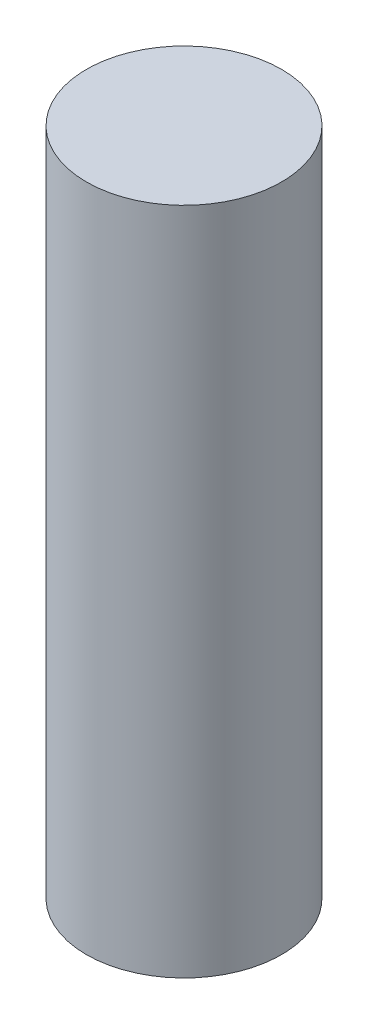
ISO-10303-21;
HEADER;
FILE_DESCRIPTION(('STEP AP214'),'2;1');
FILE_NAME('part.step','',(''),(''),'','','');
FILE_SCHEMA(('AUTOMOTIVE_DESIGN { 1 0 10303 214 1 1 1 1 }'));
ENDSEC;
DATA;
#1=APPLICATION_CONTEXT('core data for automotive mechanical design processes');
#2=APPLICATION_PROTOCOL_DEFINITION('international standard','automotive_design',2000,#1);
#3=PRODUCT_CONTEXT('',#1,'mechanical');
#4=PRODUCT('Part','Part','',(#3));
#5=PRODUCT_RELATED_PRODUCT_CATEGORY('part','',(#4));
#6=PRODUCT_DEFINITION_FORMATION('','',#4);
#7=PRODUCT_DEFINITION_CONTEXT('part definition',#1,'design');
#8=PRODUCT_DEFINITION('design','',#6,#7);
#9=PRODUCT_DEFINITION_SHAPE('','',#8);
#10=(LENGTH_UNIT() NAMED_UNIT(*) SI_UNIT(.MILLI.,.METRE.));
#11=(NAMED_UNIT(*) PLANE_ANGLE_UNIT() SI_UNIT($,.RADIAN.));
#12=(NAMED_UNIT(*) SI_UNIT($,.STERADIAN.) SOLID_ANGLE_UNIT());
#13=UNCERTAINTY_MEASURE_WITH_UNIT(LENGTH_MEASURE(1.E-05),#10,'distance_accuracy_value','');
#14=(GEOMETRIC_REPRESENTATION_CONTEXT(3) GLOBAL_UNCERTAINTY_ASSIGNED_CONTEXT((#13)) GLOBAL_UNIT_ASSIGNED_CONTEXT((#10,
#11,#12)) REPRESENTATION_CONTEXT('',''));
#15=CARTESIAN_POINT('',(0.,0.,0.));
#16=DIRECTION('',(0.,0.,1.));
#17=DIRECTION('',(1.,0.,0.));
#18=AXIS2_PLACEMENT_3D('',#15,#16,#17);
#19=CARTESIAN_POINT('',(0.,304.8,0.));
#20=DIRECTION('',(0.,-1.,0.));
#21=DIRECTION('',(0.,0.,-1.));
#22=AXIS2_PLACEMENT_3D('',#19,#20,#21);
#23=CYLINDRICAL_SURFACE('',#22,44.45);
#24=CARTESIAN_POINT('',(0.,304.8,0.));
#25=DIRECTION('',(0.,1.,0.));
#26=DIRECTION('',(0.,0.,1.));
#27=AXIS2_PLACEMENT_3D('',#24,#25,#26);
#28=CIRCLE('',#27,44.45);
#29=CARTESIAN_POINT('',(0.,304.8,-44.45));
#30=VERTEX_POINT('',#29);
#31=EDGE_CURVE('E10',#30,#30,#28,.T.);
#32=CARTESIAN_POINT('',(0.,0.,0.));
#33=DIRECTION('',(0.,1.,0.));
#34=DIRECTION('',(0.,0.,1.));
#35=AXIS2_PLACEMENT_3D('',#32,#33,#34);
#36=CIRCLE('',#35,44.45);
#37=CARTESIAN_POINT('',(0.,0.,-44.45));
#38=VERTEX_POINT('',#37);
#39=EDGE_CURVE('E34',#38,#38,#36,.T.);
#40=CARTESIAN_POINT('',(0.,304.8,-44.45));
#41=CARTESIAN_POINT('',(0.,301.625,-44.45));
#42=CARTESIAN_POINT('',(0.,298.45,-44.45));
#43=CARTESIAN_POINT('',(0.,292.1,-44.45));
#44=CARTESIAN_POINT('',(0.,288.925,-44.45));
#45=CARTESIAN_POINT('',(0.,282.575,-44.45));
#46=CARTESIAN_POINT('',(0.,279.4,-44.45));
#47=CARTESIAN_POINT('',(0.,273.05,-44.45));
#48=CARTESIAN_POINT('',(0.,269.875,-44.45));
#49=CARTESIAN_POINT('',(0.,263.525,-44.45));
#50=CARTESIAN_POINT('',(0.,260.35,-44.45));
#51=CARTESIAN_POINT('',(0.,254.,-44.45));
#52=CARTESIAN_POINT('',(0.,250.825,-44.45));
#53=CARTESIAN_POINT('',(0.,244.475,-44.45));
#54=CARTESIAN_POINT('',(0.,241.3,-44.45));
#55=CARTESIAN_POINT('',(0.,234.95,-44.45));
#56=CARTESIAN_POINT('',(0.,231.775,-44.45));
#57=CARTESIAN_POINT('',(0.,225.425,-44.45));
#58=CARTESIAN_POINT('',(0.,222.25,-44.45));
#59=CARTESIAN_POINT('',(0.,215.9,-44.45));
#60=CARTESIAN_POINT('',(0.,212.725,-44.45));
#61=CARTESIAN_POINT('',(0.,206.375,-44.45));
#62=CARTESIAN_POINT('',(0.,203.2,-44.45));
#63=CARTESIAN_POINT('',(0.,196.85,-44.45));
#64=CARTESIAN_POINT('',(0.,193.675,-44.45));
#65=CARTESIAN_POINT('',(0.,187.325,-44.45));
#66=CARTESIAN_POINT('',(0.,184.15,-44.45));
#67=CARTESIAN_POINT('',(0.,177.8,-44.45));
#68=CARTESIAN_POINT('',(0.,174.625,-44.45));
#69=CARTESIAN_POINT('',(0.,168.275,-44.45));
#70=CARTESIAN_POINT('',(0.,165.1,-44.45));
#71=CARTESIAN_POINT('',(0.,158.75,-44.45));
#72=CARTESIAN_POINT('',(0.,155.575,-44.45));
#73=CARTESIAN_POINT('',(0.,149.225,-44.45));
#74=CARTESIAN_POINT('',(0.,146.05,-44.45));
#75=CARTESIAN_POINT('',(0.,139.7,-44.45));
#76=CARTESIAN_POINT('',(0.,136.525,-44.45));
#77=CARTESIAN_POINT('',(0.,130.175,-44.45));
#78=CARTESIAN_POINT('',(0.,127.,-44.45));
#79=CARTESIAN_POINT('',(0.,120.65,-44.45));
#80=CARTESIAN_POINT('',(0.,117.475,-44.45));
#81=CARTESIAN_POINT('',(0.,111.125,-44.45));
#82=CARTESIAN_POINT('',(0.,107.95,-44.45));
#83=CARTESIAN_POINT('',(0.,101.6,-44.45));
#84=CARTESIAN_POINT('',(0.,98.425,-44.45));
#85=CARTESIAN_POINT('',(0.,92.075,-44.45));
#86=CARTESIAN_POINT('',(0.,88.9,-44.45));
#87=CARTESIAN_POINT('',(0.,82.55,-44.45));
#88=CARTESIAN_POINT('',(0.,79.375,-44.45));
#89=CARTESIAN_POINT('',(0.,73.025,-44.45));
#90=CARTESIAN_POINT('',(0.,69.85,-44.45));
#91=CARTESIAN_POINT('',(0.,63.5,-44.45));
#92=CARTESIAN_POINT('',(0.,60.325,-44.45));
#93=CARTESIAN_POINT('',(0.,53.975,-44.45));
#94=CARTESIAN_POINT('',(0.,50.8,-44.45));
#95=CARTESIAN_POINT('',(0.,44.45,-44.45));
#96=CARTESIAN_POINT('',(0.,41.275,-44.45));
#97=CARTESIAN_POINT('',(0.,34.925,-44.45));
#98=CARTESIAN_POINT('',(0.,31.75,-44.45));
#99=CARTESIAN_POINT('',(0.,25.4,-44.45));
#100=CARTESIAN_POINT('',(0.,22.225,-44.45));
#101=CARTESIAN_POINT('',(0.,15.875,-44.45));
#102=CARTESIAN_POINT('',(0.,12.7,-44.45));
#103=CARTESIAN_POINT('',(0.,6.35,-44.45));
#104=CARTESIAN_POINT('',(0.,3.175,-44.45));
#105=CARTESIAN_POINT('',(0.,0.,-44.45));
#106=B_SPLINE_CURVE_WITH_KNOTS('',3,(#40,#41,#42,#43,#44,#45,#46,#47,#48,#49,#50,#51,#52,#53,
#54,#55,#56,#57,#58,#59,#60,#61,#62,#63,#64,#65,#66,#67,#68,#69,#70,#71,#72,#73,#74,#75,#76,#77,
#78,#79,#80,#81,#82,#83,#84,#85,#86,#87,#88,#89,#90,#91,#92,#93,#94,#95,#96,#97,#98,#99,#100,
#101,#102,#103,#104,#105),.UNSPECIFIED.,.F.,.F.,(4,2,2,2,2,2,2,2,2,2,2,2,2,2,2,2,2,2,2,2,2,2,2,
2,2,2,2,2,2,2,2,2,4),(0.,9.52499999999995,19.05,28.575,38.1,47.625,57.15,66.675,76.2,85.725,
95.2499999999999,104.775,114.3,123.825,133.35,142.875,152.4,161.925,171.45,180.975,190.5,
200.025,209.55,219.075,228.6,238.125,247.65,257.175,266.7,276.225,285.75,295.275,304.8),.UNSPECIFIED.);
#107=EDGE_CURVE('BSEAM31',#30,#38,#106,.T.);
#108=ORIENTED_EDGE('',*,*,#31,.F.);
#109=ORIENTED_EDGE('',*,*,#39,.T.);
#110=ORIENTED_EDGE('',*,*,#107,.T.);
#111=ORIENTED_EDGE('',*,*,#107,.F.);
#112=EDGE_LOOP('',(#108,#110,#109,#111));
#113=FACE_BOUND('',#112,.T.);
#114=ADVANCED_FACE('F31',(#113),#23,.T.);
#115=CARTESIAN_POINT('',(0.,304.8,0.));
#116=DIRECTION('',(0.,1.,0.));
#117=DIRECTION('',(0.,0.,1.));
#118=AXIS2_PLACEMENT_3D('',#115,#116,#117);
#119=PLANE('',#118);
#120=ORIENTED_EDGE('',*,*,#31,.T.);
#121=EDGE_LOOP('',(#120));
#122=FACE_BOUND('',#121,.T.);
#123=ADVANCED_FACE('F46',(#122),#119,.T.);
#124=CARTESIAN_POINT('',(0.,0.,0.));
#125=DIRECTION('',(0.,1.,0.));
#126=DIRECTION('',(0.,0.,1.));
#127=AXIS2_PLACEMENT_3D('',#124,#125,#126);
#128=PLANE('',#127);
#129=ORIENTED_EDGE('',*,*,#39,.F.);
#130=EDGE_LOOP('',(#129));
#131=FACE_BOUND('',#130,.T.);
#132=ADVANCED_FACE('F44',(#131),#128,.F.);
#133=CLOSED_SHELL('',(#114,#123,#132));
#134=MANIFOLD_SOLID_BREP('B2',#133);
#135=ADVANCED_BREP_SHAPE_REPRESENTATION('',(#18,#134),#14);
#136=SHAPE_DEFINITION_REPRESENTATION(#9,#135);
ENDSEC;
END-ISO-10303-21;
